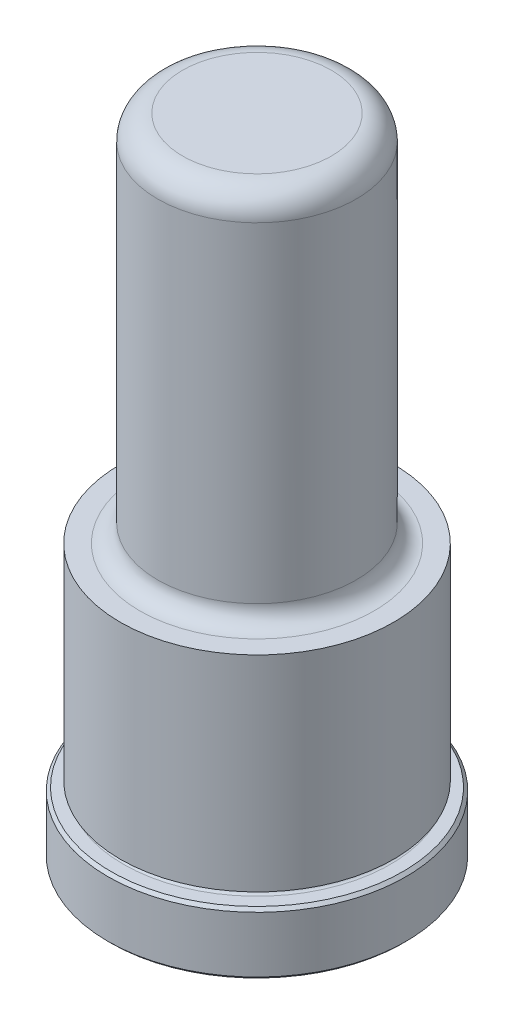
from build123d import *

# Parameters (mm, degrees)
CHAMFER1_SIZE = 0.381
FILLET7_R     = 3.175


with BuildPart() as part:
    # Sketch1 → Revolve1 (revolve)
    with BuildSketch(Plane(origin=(0, 0, 0), x_dir=(0, 0, -1), z_dir=(1, 0, 0)), mode=Mode.PRIVATE) as revolve1_sk:
        with BuildLine():
            Line((0, 0), (19.05, 0))
            Line((19.05, 0), (19.05, 7.9248))
            Line((19.05, 7.9248), (17.0688, 7.9248))
            ThreePointArc((17.0688, 7.9248), (16.6878, 8.3058), (17.0688, 8.6868))
            Line((17.0688, 8.6868), (17.4752, 8.6868))
            Line((17.4752, 8.6868), (17.4752, 34.925))
            Line((17.4752, 34.925), (14.9733, 34.925))
            ThreePointArc((14.9733, 34.925), (13.356853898, 35.594553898), (12.6873, 37.211))
            Line((12.6873, 37.211), (12.6873, 82.55))
            Line((12.6873, 82.55), (0, 82.55))
            Line((0, 82.55), (0, 0))
        make_face()
    revolve(revolve1_sk.sketch.rotate(Axis((0, 0, 0), (0, -1, 0)), 180), axis=Axis((0, 0, 0), (0, -1, 0)))

    # Chamfer1
    chamfer1_edges = [part.edges().sort_by_distance(p)[0] for p in [
        (0, 7.9248, -19.05),
        (0, 0, -19.05),
    ]]
    chamfer(chamfer1_edges, length=CHAMFER1_SIZE)

    # Fillet7
    fillet7_edges = [part.edges().sort_by_distance(p)[0] for p in [
        (0, 82.55, -12.6873),
    ]]
    fillet(fillet7_edges, radius=FILLET7_R)


solid = part.part
